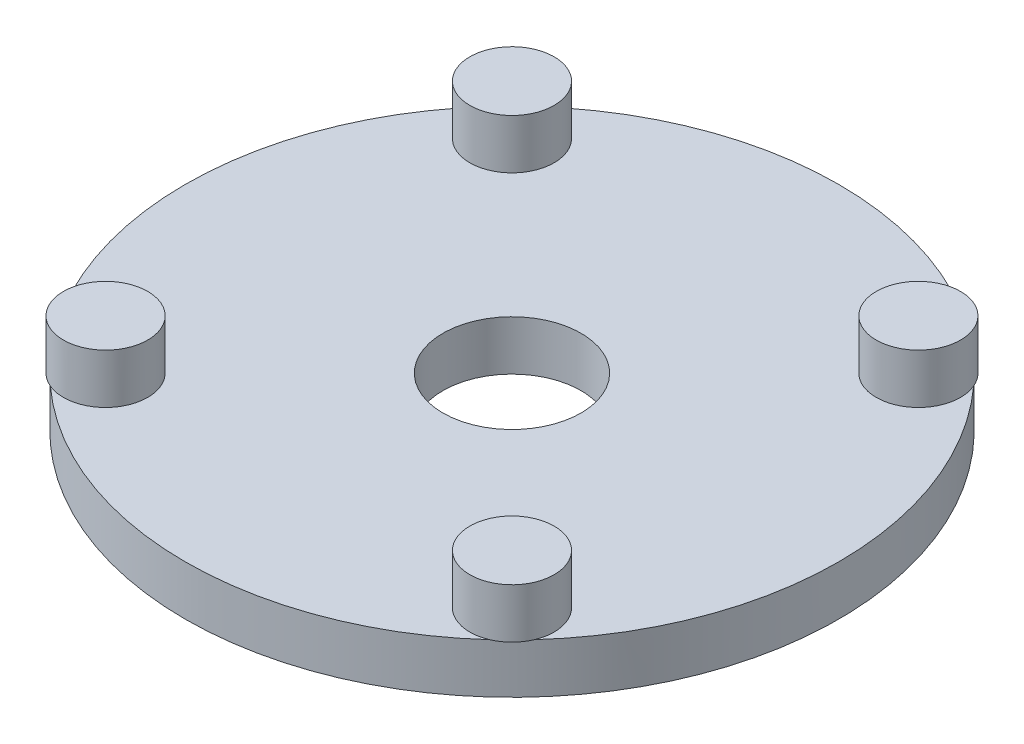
ISO-10303-21;
HEADER;
FILE_DESCRIPTION(('STEP AP214'),'2;1');
FILE_NAME('part.step','',(''),(''),'','','');
FILE_SCHEMA(('AUTOMOTIVE_DESIGN { 1 0 10303 214 1 1 1 1 }'));
ENDSEC;
DATA;
#1=APPLICATION_CONTEXT('core data for automotive mechanical design processes');
#2=APPLICATION_PROTOCOL_DEFINITION('international standard','automotive_design',2000,#1);
#3=PRODUCT_CONTEXT('',#1,'mechanical');
#4=PRODUCT('Part','Part','',(#3));
#5=PRODUCT_RELATED_PRODUCT_CATEGORY('part','',(#4));
#6=PRODUCT_DEFINITION_FORMATION('','',#4);
#7=PRODUCT_DEFINITION_CONTEXT('part definition',#1,'design');
#8=PRODUCT_DEFINITION('design','',#6,#7);
#9=PRODUCT_DEFINITION_SHAPE('','',#8);
#10=(LENGTH_UNIT() NAMED_UNIT(*) SI_UNIT(.MILLI.,.METRE.));
#11=(NAMED_UNIT(*) PLANE_ANGLE_UNIT() SI_UNIT($,.RADIAN.));
#12=(NAMED_UNIT(*) SI_UNIT($,.STERADIAN.) SOLID_ANGLE_UNIT());
#13=UNCERTAINTY_MEASURE_WITH_UNIT(LENGTH_MEASURE(1.E-05),#10,'distance_accuracy_value','');
#14=(GEOMETRIC_REPRESENTATION_CONTEXT(3) GLOBAL_UNCERTAINTY_ASSIGNED_CONTEXT((#13)) GLOBAL_UNIT_ASSIGNED_CONTEXT((#10,
#11,#12)) REPRESENTATION_CONTEXT('',''));
#15=CARTESIAN_POINT('',(0.,0.,0.));
#16=DIRECTION('',(0.,0.,1.));
#17=DIRECTION('',(1.,0.,0.));
#18=AXIS2_PLACEMENT_3D('',#15,#16,#17);
#19=CARTESIAN_POINT('',(0.,4.41,0.));
#20=DIRECTION('',(0.,-1.,0.));
#21=DIRECTION('',(0.,0.,-1.));
#22=AXIS2_PLACEMENT_3D('',#19,#20,#21);
#23=CYLINDRICAL_SURFACE('',#22,29.);
#24=CARTESIAN_POINT('',(0.,4.41,0.));
#25=DIRECTION('',(0.,1.,0.));
#26=DIRECTION('',(0.,0.,1.));
#27=AXIS2_PLACEMENT_3D('',#24,#25,#26);
#28=CIRCLE('',#27,29.);
#29=CARTESIAN_POINT('',(19.4882915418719,4.41,21.4757186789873));
#30=VERTEX_POINT('',#29);
#31=CARTESIAN_POINT('',(21.475718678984,4.41,19.4882915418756));
#32=VERTEX_POINT('',#31);
#33=EDGE_CURVE('E108',#30,#32,#28,.T.);
#34=ORIENTED_EDGE('',*,*,#33,.F.);
#35=CARTESIAN_POINT('',(-19.4882915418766,4.41,21.4757186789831));
#36=VERTEX_POINT('',#35);
#37=EDGE_CURVE('E125',#36,#30,#28,.T.);
#38=ORIENTED_EDGE('',*,*,#37,.F.);
#39=CARTESIAN_POINT('',(-21.4757186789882,4.41,19.488291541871));
#40=VERTEX_POINT('',#39);
#41=EDGE_CURVE('E131',#40,#36,#28,.T.);
#42=ORIENTED_EDGE('',*,*,#41,.F.);
#43=CARTESIAN_POINT('',(-21.4757186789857,4.41,-19.4882915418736));
#44=VERTEX_POINT('',#43);
#45=EDGE_CURVE('E99',#44,#40,#28,.T.);
#46=ORIENTED_EDGE('',*,*,#45,.F.);
#47=CARTESIAN_POINT('',(-19.4882915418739,4.41,-21.4757186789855));
#48=VERTEX_POINT('',#47);
#49=EDGE_CURVE('E95',#48,#44,#28,.T.);
#50=ORIENTED_EDGE('',*,*,#49,.F.);
#51=CARTESIAN_POINT('',(19.4882915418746,4.41,-21.4757186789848));
#52=VERTEX_POINT('',#51);
#53=EDGE_CURVE('E85',#52,#48,#28,.T.);
#54=ORIENTED_EDGE('',*,*,#53,.F.);
#55=CARTESIAN_POINT('',(21.4757186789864,4.41,-19.4882915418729));
#56=VERTEX_POINT('',#55);
#57=EDGE_CURVE('E94',#56,#52,#28,.T.);
#58=ORIENTED_EDGE('',*,*,#57,.F.);
#59=EDGE_CURVE('E124',#32,#56,#28,.T.);
#60=ORIENTED_EDGE('',*,*,#59,.F.);
#61=EDGE_LOOP('',(#34,#38,#42,#46,#50,#54,#58,#60));
#62=FACE_BOUND('',#61,.T.);
#63=CARTESIAN_POINT('',(0.,0.,0.));
#64=DIRECTION('',(0.,1.,0.));
#65=DIRECTION('',(0.,0.,1.));
#66=AXIS2_PLACEMENT_3D('',#63,#64,#65);
#67=CIRCLE('',#66,29.);
#68=CARTESIAN_POINT('',(0.,0.,29.));
#69=VERTEX_POINT('',#68);
#70=EDGE_CURVE('E48',#69,#69,#67,.T.);
#71=ORIENTED_EDGE('',*,*,#70,.T.);
#72=EDGE_LOOP('',(#71));
#73=FACE_BOUND('',#72,.T.);
#74=ADVANCED_FACE('F45',(#62,#73),#23,.T.);
#75=CARTESIAN_POINT('',(0.,4.41,0.));
#76=DIRECTION('',(0.,1.,0.));
#77=DIRECTION('',(0.,0.,1.));
#78=AXIS2_PLACEMENT_3D('',#75,#76,#77);
#79=PLANE('',#78);
#80=CARTESIAN_POINT('',(0.,4.41,0.));
#81=DIRECTION('',(0.,1.,0.));
#82=DIRECTION('',(0.,0.,1.));
#83=AXIS2_PLACEMENT_3D('',#80,#81,#82);
#84=CIRCLE('',#83,6.13);
#85=CARTESIAN_POINT('',(0.,4.41,6.13));
#86=VERTEX_POINT('',#85);
#87=EDGE_CURVE('E293',#86,#86,#84,.T.);
#88=ORIENTED_EDGE('',*,*,#87,.F.);
#89=EDGE_LOOP('',(#88));
#90=FACE_BOUND('',#89,.T.);
#91=CARTESIAN_POINT('',(-18.0312229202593,4.41,18.0312229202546));
#92=DIRECTION('',(0.,1.,0.));
#93=DIRECTION('',(0.,0.,1.));
#94=AXIS2_PLACEMENT_3D('',#91,#92,#93);
#95=CIRCLE('',#94,3.74000000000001);
#96=EDGE_CURVE('E11',#36,#40,#95,.T.);
#97=ORIENTED_EDGE('',*,*,#96,.F.);
#98=ORIENTED_EDGE('',*,*,#37,.T.);
#99=CARTESIAN_POINT('',(18.0312229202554,4.41,18.0312229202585));
#100=DIRECTION('',(0.,1.,0.));
#101=DIRECTION('',(0.,0.,1.));
#102=AXIS2_PLACEMENT_3D('',#99,#100,#101);
#103=CIRCLE('',#102,3.74000000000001);
#104=EDGE_CURVE('E54',#32,#30,#103,.T.);
#105=ORIENTED_EDGE('',*,*,#104,.F.);
#106=ORIENTED_EDGE('',*,*,#59,.T.);
#107=CARTESIAN_POINT('',(18.0312229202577,4.41,-18.0312229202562));
#108=DIRECTION('',(0.,1.,0.));
#109=DIRECTION('',(0.,0.,1.));
#110=AXIS2_PLACEMENT_3D('',#107,#108,#109);
#111=CIRCLE('',#110,3.74);
#112=EDGE_CURVE('E89',#52,#56,#111,.T.);
#113=ORIENTED_EDGE('',*,*,#112,.F.);
#114=ORIENTED_EDGE('',*,*,#53,.T.);
#115=CARTESIAN_POINT('',(-18.0312229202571,4.41,-18.0312229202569));
#116=DIRECTION('',(0.,1.,0.));
#117=DIRECTION('',(0.,0.,1.));
#118=AXIS2_PLACEMENT_3D('',#115,#116,#117);
#119=CIRCLE('',#118,3.74000000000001);
#120=EDGE_CURVE('E67',#44,#48,#119,.T.);
#121=ORIENTED_EDGE('',*,*,#120,.F.);
#122=ORIENTED_EDGE('',*,*,#45,.T.);
#123=EDGE_LOOP('',(#97,#98,#105,#106,#113,#114,#121,#122));
#124=FACE_BOUND('',#123,.T.);
#125=ADVANCED_FACE('F87',(#90,#124),#79,.T.);
#126=CARTESIAN_POINT('',(0.,0.,0.));
#127=DIRECTION('',(0.,1.,0.));
#128=DIRECTION('',(0.,0.,1.));
#129=AXIS2_PLACEMENT_3D('',#126,#127,#128);
#130=PLANE('',#129);
#131=CARTESIAN_POINT('',(0.,0.,0.));
#132=DIRECTION('',(0.,1.,0.));
#133=DIRECTION('',(0.,0.,1.));
#134=AXIS2_PLACEMENT_3D('',#131,#132,#133);
#135=CIRCLE('',#134,6.13);
#136=CARTESIAN_POINT('',(0.,0.,6.13));
#137=VERTEX_POINT('',#136);
#138=EDGE_CURVE('E295',#137,#137,#135,.F.);
#139=ORIENTED_EDGE('',*,*,#138,.F.);
#140=EDGE_LOOP('',(#139));
#141=FACE_BOUND('',#140,.T.);
#142=ORIENTED_EDGE('',*,*,#70,.F.);
#143=EDGE_LOOP('',(#142));
#144=FACE_BOUND('',#143,.T.);
#145=ADVANCED_FACE('F139',(#141,#144),#130,.F.);
#146=CARTESIAN_POINT('',(-18.0312229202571,4.41,-18.0312229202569));
#147=DIRECTION('',(0.,1.,0.));
#148=DIRECTION('',(0.,0.,1.));
#149=AXIS2_PLACEMENT_3D('',#146,#147,#148);
#150=PLANE('',#149);
#151=EDGE_CURVE('E106',#48,#44,#119,.T.);
#152=ORIENTED_EDGE('',*,*,#151,.F.);
#153=ORIENTED_EDGE('',*,*,#49,.T.);
#154=EDGE_LOOP('',(#152,#153));
#155=FACE_BOUND('',#154,.T.);
#156=ADVANCED_FACE('F110',(#155),#150,.F.);
#157=CARTESIAN_POINT('',(-18.0312229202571,8.82,-18.0312229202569));
#158=DIRECTION('',(0.,-1.,0.));
#159=DIRECTION('',(0.,0.,-1.));
#160=AXIS2_PLACEMENT_3D('',#157,#158,#159);
#161=CYLINDRICAL_SURFACE('',#160,3.74000000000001);
#162=CARTESIAN_POINT('',(-18.0312229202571,8.82,-18.0312229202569));
#163=DIRECTION('',(0.,1.,0.));
#164=DIRECTION('',(0.,0.,1.));
#165=AXIS2_PLACEMENT_3D('',#162,#163,#164);
#166=CIRCLE('',#165,3.74000000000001);
#167=CARTESIAN_POINT('',(-18.0312229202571,8.82,-14.2912229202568));
#168=VERTEX_POINT('',#167);
#169=EDGE_CURVE('E112',#168,#168,#166,.T.);
#170=ORIENTED_EDGE('',*,*,#169,.F.);
#171=EDGE_LOOP('',(#170));
#172=FACE_BOUND('',#171,.T.);
#173=ORIENTED_EDGE('',*,*,#151,.T.);
#174=ORIENTED_EDGE('',*,*,#120,.T.);
#175=EDGE_LOOP('',(#173,#174));
#176=FACE_BOUND('',#175,.T.);
#177=ADVANCED_FACE('F105',(#172,#176),#161,.T.);
#178=CARTESIAN_POINT('',(-18.0312229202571,8.82,-18.0312229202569));
#179=DIRECTION('',(0.,1.,0.));
#180=DIRECTION('',(0.,0.,1.));
#181=AXIS2_PLACEMENT_3D('',#178,#179,#180);
#182=PLANE('',#181);
#183=ORIENTED_EDGE('',*,*,#169,.T.);
#184=EDGE_LOOP('',(#183));
#185=FACE_BOUND('',#184,.T.);
#186=ADVANCED_FACE('F167',(#185),#182,.T.);
#187=CARTESIAN_POINT('',(18.0312229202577,4.41,-18.0312229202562));
#188=DIRECTION('',(0.,1.,0.));
#189=DIRECTION('',(0.,0.,1.));
#190=AXIS2_PLACEMENT_3D('',#187,#188,#189);
#191=PLANE('',#190);
#192=EDGE_CURVE('E113',#56,#52,#111,.T.);
#193=ORIENTED_EDGE('',*,*,#192,.F.);
#194=ORIENTED_EDGE('',*,*,#57,.T.);
#195=EDGE_LOOP('',(#193,#194));
#196=FACE_BOUND('',#195,.T.);
#197=ADVANCED_FACE('F176',(#196),#191,.F.);
#198=CARTESIAN_POINT('',(18.0312229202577,8.82,-18.0312229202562));
#199=DIRECTION('',(0.,-1.,0.));
#200=DIRECTION('',(0.,0.,-1.));
#201=AXIS2_PLACEMENT_3D('',#198,#199,#200);
#202=CYLINDRICAL_SURFACE('',#201,3.74);
#203=CARTESIAN_POINT('',(18.0312229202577,8.82,-18.0312229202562));
#204=DIRECTION('',(0.,1.,0.));
#205=DIRECTION('',(0.,0.,1.));
#206=AXIS2_PLACEMENT_3D('',#203,#204,#205);
#207=CIRCLE('',#206,3.74);
#208=CARTESIAN_POINT('',(18.0312229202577,8.82,-14.2912229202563));
#209=VERTEX_POINT('',#208);
#210=EDGE_CURVE('E119',#209,#209,#207,.T.);
#211=ORIENTED_EDGE('',*,*,#210,.F.);
#212=EDGE_LOOP('',(#211));
#213=FACE_BOUND('',#212,.T.);
#214=ORIENTED_EDGE('',*,*,#192,.T.);
#215=ORIENTED_EDGE('',*,*,#112,.T.);
#216=EDGE_LOOP('',(#214,#215));
#217=FACE_BOUND('',#216,.T.);
#218=ADVANCED_FACE('F185',(#213,#217),#202,.T.);
#219=CARTESIAN_POINT('',(18.0312229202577,8.82,-18.0312229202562));
#220=DIRECTION('',(0.,1.,0.));
#221=DIRECTION('',(0.,0.,1.));
#222=AXIS2_PLACEMENT_3D('',#219,#220,#221);
#223=PLANE('',#222);
#224=ORIENTED_EDGE('',*,*,#210,.T.);
#225=EDGE_LOOP('',(#224));
#226=FACE_BOUND('',#225,.T.);
#227=ADVANCED_FACE('F194',(#226),#223,.T.);
#228=CARTESIAN_POINT('',(18.0312229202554,4.41,18.0312229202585));
#229=DIRECTION('',(0.,1.,0.));
#230=DIRECTION('',(0.,0.,1.));
#231=AXIS2_PLACEMENT_3D('',#228,#229,#230);
#232=PLANE('',#231);
#233=EDGE_CURVE('E307',#30,#32,#103,.T.);
#234=ORIENTED_EDGE('',*,*,#233,.F.);
#235=ORIENTED_EDGE('',*,*,#33,.T.);
#236=EDGE_LOOP('',(#234,#235));
#237=FACE_BOUND('',#236,.T.);
#238=ADVANCED_FACE('F203',(#237),#232,.F.);
#239=CARTESIAN_POINT('',(18.0312229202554,8.82,18.0312229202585));
#240=DIRECTION('',(0.,-1.,0.));
#241=DIRECTION('',(0.,0.,-1.));
#242=AXIS2_PLACEMENT_3D('',#239,#240,#241);
#243=CYLINDRICAL_SURFACE('',#242,3.74000000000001);
#244=CARTESIAN_POINT('',(18.0312229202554,8.82,18.0312229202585));
#245=DIRECTION('',(0.,1.,0.));
#246=DIRECTION('',(0.,0.,1.));
#247=AXIS2_PLACEMENT_3D('',#244,#245,#246);
#248=CIRCLE('',#247,3.74000000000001);
#249=CARTESIAN_POINT('',(18.0312229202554,8.82,21.7712229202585));
#250=VERTEX_POINT('',#249);
#251=EDGE_CURVE('E310',#250,#250,#248,.T.);
#252=ORIENTED_EDGE('',*,*,#251,.F.);
#253=EDGE_LOOP('',(#252));
#254=FACE_BOUND('',#253,.T.);
#255=ORIENTED_EDGE('',*,*,#233,.T.);
#256=ORIENTED_EDGE('',*,*,#104,.T.);
#257=EDGE_LOOP('',(#255,#256));
#258=FACE_BOUND('',#257,.T.);
#259=ADVANCED_FACE('F212',(#254,#258),#243,.T.);
#260=CARTESIAN_POINT('',(18.0312229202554,8.82,18.0312229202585));
#261=DIRECTION('',(0.,1.,0.));
#262=DIRECTION('',(0.,0.,1.));
#263=AXIS2_PLACEMENT_3D('',#260,#261,#262);
#264=PLANE('',#263);
#265=ORIENTED_EDGE('',*,*,#251,.T.);
#266=EDGE_LOOP('',(#265));
#267=FACE_BOUND('',#266,.T.);
#268=ADVANCED_FACE('F220',(#267),#264,.T.);
#269=CARTESIAN_POINT('',(-18.0312229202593,4.41,18.0312229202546));
#270=DIRECTION('',(0.,1.,0.));
#271=DIRECTION('',(0.,0.,1.));
#272=AXIS2_PLACEMENT_3D('',#269,#270,#271);
#273=PLANE('',#272);
#274=EDGE_CURVE('E56',#40,#36,#95,.T.);
#275=ORIENTED_EDGE('',*,*,#274,.F.);
#276=ORIENTED_EDGE('',*,*,#41,.T.);
#277=EDGE_LOOP('',(#275,#276));
#278=FACE_BOUND('',#277,.T.);
#279=ADVANCED_FACE('F229',(#278),#273,.F.);
#280=CARTESIAN_POINT('',(-18.0312229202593,8.82,18.0312229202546));
#281=DIRECTION('',(0.,-1.,0.));
#282=DIRECTION('',(0.,0.,-1.));
#283=AXIS2_PLACEMENT_3D('',#280,#281,#282);
#284=CYLINDRICAL_SURFACE('',#283,3.74000000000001);
#285=CARTESIAN_POINT('',(-18.0312229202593,8.82,18.0312229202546));
#286=DIRECTION('',(0.,1.,0.));
#287=DIRECTION('',(0.,0.,1.));
#288=AXIS2_PLACEMENT_3D('',#285,#286,#287);
#289=CIRCLE('',#288,3.74000000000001);
#290=CARTESIAN_POINT('',(-18.0312229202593,8.82,21.7712229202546));
#291=VERTEX_POINT('',#290);
#292=EDGE_CURVE('E297',#291,#291,#289,.T.);
#293=ORIENTED_EDGE('',*,*,#292,.F.);
#294=EDGE_LOOP('',(#293));
#295=FACE_BOUND('',#294,.T.);
#296=ORIENTED_EDGE('',*,*,#274,.T.);
#297=ORIENTED_EDGE('',*,*,#96,.T.);
#298=EDGE_LOOP('',(#296,#297));
#299=FACE_BOUND('',#298,.T.);
#300=ADVANCED_FACE('F238',(#295,#299),#284,.T.);
#301=CARTESIAN_POINT('',(-18.0312229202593,8.82,18.0312229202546));
#302=DIRECTION('',(0.,1.,0.));
#303=DIRECTION('',(0.,0.,1.));
#304=AXIS2_PLACEMENT_3D('',#301,#302,#303);
#305=PLANE('',#304);
#306=ORIENTED_EDGE('',*,*,#292,.T.);
#307=EDGE_LOOP('',(#306));
#308=FACE_BOUND('',#307,.T.);
#309=ADVANCED_FACE('F247',(#308),#305,.T.);
#310=CARTESIAN_POINT('',(0.,-0.00100000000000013,0.));
#311=DIRECTION('',(0.,1.,0.));
#312=DIRECTION('',(0.,0.,1.));
#313=AXIS2_PLACEMENT_3D('',#310,#311,#312);
#314=CYLINDRICAL_SURFACE('',#313,6.13);
#315=ORIENTED_EDGE('',*,*,#87,.T.);
#316=EDGE_LOOP('',(#315));
#317=FACE_BOUND('',#316,.T.);
#318=ORIENTED_EDGE('',*,*,#138,.T.);
#319=EDGE_LOOP('',(#318));
#320=FACE_BOUND('',#319,.T.);
#321=ADVANCED_FACE('F255',(#317,#320),#314,.F.);
#322=CLOSED_SHELL('',(#74,#125,#145,#156,#177,#186,#197,#218,#227,#238,#259,#268,#279,#300,#309,#321));
#323=MANIFOLD_SOLID_BREP('B2',#322);
#324=ADVANCED_BREP_SHAPE_REPRESENTATION('',(#18,#323),#14);
#325=SHAPE_DEFINITION_REPRESENTATION(#9,#324);
ENDSEC;
END-ISO-10303-21;
